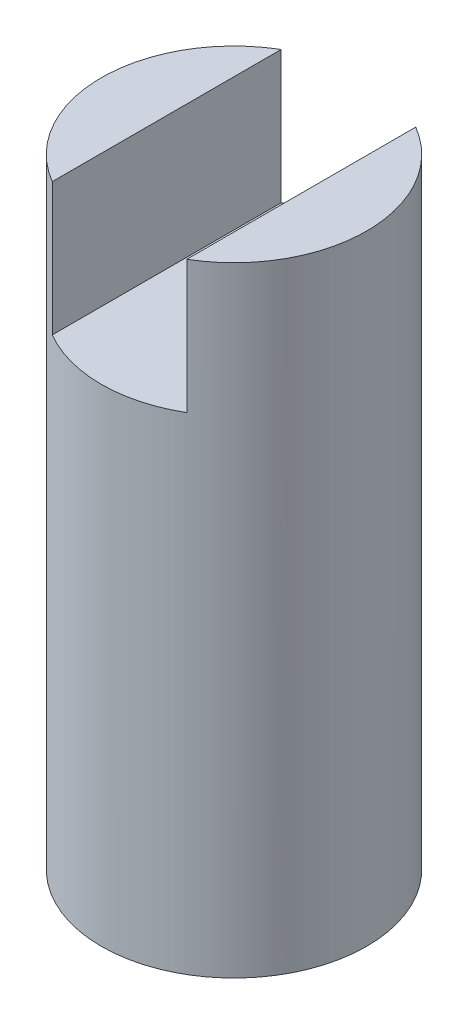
ISO-10303-21;
HEADER;
FILE_DESCRIPTION(('STEP AP214'),'2;1');
FILE_NAME('part.step','',(''),(''),'','','');
FILE_SCHEMA(('AUTOMOTIVE_DESIGN { 1 0 10303 214 1 1 1 1 }'));
ENDSEC;
DATA;
#1=APPLICATION_CONTEXT('core data for automotive mechanical design processes');
#2=APPLICATION_PROTOCOL_DEFINITION('international standard','automotive_design',2000,#1);
#3=PRODUCT_CONTEXT('',#1,'mechanical');
#4=PRODUCT('Part','Part','',(#3));
#5=PRODUCT_RELATED_PRODUCT_CATEGORY('part','',(#4));
#6=PRODUCT_DEFINITION_FORMATION('','',#4);
#7=PRODUCT_DEFINITION_CONTEXT('part definition',#1,'design');
#8=PRODUCT_DEFINITION('design','',#6,#7);
#9=PRODUCT_DEFINITION_SHAPE('','',#8);
#10=(LENGTH_UNIT() NAMED_UNIT(*) SI_UNIT(.MILLI.,.METRE.));
#11=(NAMED_UNIT(*) PLANE_ANGLE_UNIT() SI_UNIT($,.RADIAN.));
#12=(NAMED_UNIT(*) SI_UNIT($,.STERADIAN.) SOLID_ANGLE_UNIT());
#13=UNCERTAINTY_MEASURE_WITH_UNIT(LENGTH_MEASURE(1.E-05),#10,'distance_accuracy_value','');
#14=(GEOMETRIC_REPRESENTATION_CONTEXT(3) GLOBAL_UNCERTAINTY_ASSIGNED_CONTEXT((#13)) GLOBAL_UNIT_ASSIGNED_CONTEXT((#10,
#11,#12)) REPRESENTATION_CONTEXT('',''));
#15=CARTESIAN_POINT('',(0.,0.,0.));
#16=DIRECTION('',(0.,0.,1.));
#17=DIRECTION('',(1.,0.,0.));
#18=AXIS2_PLACEMENT_3D('',#15,#16,#17);
#19=CARTESIAN_POINT('',(0.,70.0000000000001,0.));
#20=DIRECTION('',(0.,1.,0.));
#21=DIRECTION('',(0.,0.,1.));
#22=AXIS2_PLACEMENT_3D('',#19,#20,#21);
#23=PLANE('',#22);
#24=CARTESIAN_POINT('',(0.,70.0000000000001,0.));
#25=DIRECTION('',(0.,1.,0.));
#26=DIRECTION('',(0.,0.,1.));
#27=AXIS2_PLACEMENT_3D('',#24,#25,#26);
#28=CIRCLE('',#27,15.);
#29=CARTESIAN_POINT('',(7.59999999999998,70.0000000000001,12.9321305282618));
#30=VERTEX_POINT('',#29);
#31=CARTESIAN_POINT('',(7.59999999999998,70.0000000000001,-12.9321305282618));
#32=VERTEX_POINT('',#31);
#33=EDGE_CURVE('E103',#30,#32,#28,.T.);
#34=ORIENTED_EDGE('',*,*,#33,.T.);
#35=DIRECTION('',(0.,0.,1.));
#36=VECTOR('',#35,1.);
#37=CARTESIAN_POINT('',(7.59999999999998,70.0000000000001,0.));
#38=LINE('',#37,#36);
#39=EDGE_CURVE('E134',#32,#30,#38,.T.);
#40=ORIENTED_EDGE('',*,*,#39,.T.);
#41=EDGE_LOOP('',(#34,#40));
#42=FACE_BOUND('',#41,.T.);
#43=ADVANCED_FACE('F42',(#42),#23,.T.);
#44=CARTESIAN_POINT('',(0.,70.0000000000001,0.));
#45=DIRECTION('',(0.,-1.,0.));
#46=DIRECTION('',(0.,0.,-1.));
#47=AXIS2_PLACEMENT_3D('',#44,#45,#46);
#48=CYLINDRICAL_SURFACE('',#47,15.);
#49=CARTESIAN_POINT('',(-7.60000000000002,70.0000000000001,-12.9321305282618));
#50=VERTEX_POINT('',#49);
#51=CARTESIAN_POINT('',(-7.60000000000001,70.0000000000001,12.9321305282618));
#52=VERTEX_POINT('',#51);
#53=EDGE_CURVE('E131',#50,#52,#28,.T.);
#54=ORIENTED_EDGE('',*,*,#53,.F.);
#55=DIRECTION('',(0.,-1.,0.));
#56=VECTOR('',#55,1.);
#57=CARTESIAN_POINT('',(-7.60000000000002,70.0000000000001,-12.9321305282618));
#58=LINE('',#57,#56);
#59=CARTESIAN_POINT('',(-7.60000000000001,54.9999999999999,-12.9321305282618));
#60=VERTEX_POINT('',#59);
#61=EDGE_CURVE('E116',#50,#60,#58,.T.);
#62=ORIENTED_EDGE('',*,*,#61,.T.);
#63=CARTESIAN_POINT('',(0.,54.9999999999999,0.));
#64=DIRECTION('',(0.,-1.,0.));
#65=DIRECTION('',(0.,0.,-1.));
#66=AXIS2_PLACEMENT_3D('',#63,#64,#65);
#67=CIRCLE('',#66,15.);
#68=CARTESIAN_POINT('',(7.60000000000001,54.9999999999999,-12.9321305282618));
#69=VERTEX_POINT('',#68);
#70=EDGE_CURVE('E11',#60,#69,#67,.T.);
#71=ORIENTED_EDGE('',*,*,#70,.T.);
#72=DIRECTION('',(0.,-1.,0.));
#73=VECTOR('',#72,1.);
#74=CARTESIAN_POINT('',(7.59999999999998,70.0000000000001,-12.9321305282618));
#75=LINE('',#74,#73);
#76=EDGE_CURVE('E96',#32,#69,#75,.T.);
#77=ORIENTED_EDGE('',*,*,#76,.F.);
#78=ORIENTED_EDGE('',*,*,#33,.F.);
#79=DIRECTION('',(0.,-1.,0.));
#80=VECTOR('',#79,1.);
#81=CARTESIAN_POINT('',(7.59999999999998,70.0000000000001,12.9321305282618));
#82=LINE('',#81,#80);
#83=CARTESIAN_POINT('',(7.59999999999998,54.9999999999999,12.9321305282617));
#84=VERTEX_POINT('',#83);
#85=EDGE_CURVE('E58',#84,#30,#82,.F.);
#86=ORIENTED_EDGE('',*,*,#85,.F.);
#87=CARTESIAN_POINT('',(-7.60000000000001,54.9999999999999,12.9321305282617));
#88=VERTEX_POINT('',#87);
#89=EDGE_CURVE('E46',#84,#88,#67,.T.);
#90=ORIENTED_EDGE('',*,*,#89,.T.);
#91=DIRECTION('',(0.,-1.,0.));
#92=VECTOR('',#91,1.);
#93=CARTESIAN_POINT('',(-7.60000000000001,70.0000000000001,12.9321305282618));
#94=LINE('',#93,#92);
#95=EDGE_CURVE('E109',#88,#52,#94,.F.);
#96=ORIENTED_EDGE('',*,*,#95,.T.);
#97=EDGE_LOOP('',(#54,#62,#71,#77,#78,#86,#90,#96));
#98=FACE_BOUND('',#97,.T.);
#99=CARTESIAN_POINT('',(0.,0.,0.));
#100=DIRECTION('',(0.,1.,0.));
#101=DIRECTION('',(0.,0.,1.));
#102=AXIS2_PLACEMENT_3D('',#99,#100,#101);
#103=CIRCLE('',#102,15.);
#104=CARTESIAN_POINT('',(0.,0.,15.));
#105=VERTEX_POINT('',#104);
#106=EDGE_CURVE('E127',#105,#105,#103,.T.);
#107=ORIENTED_EDGE('',*,*,#106,.T.);
#108=EDGE_LOOP('',(#107));
#109=FACE_BOUND('',#108,.T.);
#110=ADVANCED_FACE('F44',(#98,#109),#48,.T.);
#111=DIRECTION('',(0.,0.,1.));
#112=VECTOR('',#111,1.);
#113=CARTESIAN_POINT('',(-7.60000000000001,70.0000000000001,0.));
#114=LINE('',#113,#112);
#115=EDGE_CURVE('E93',#50,#52,#114,.T.);
#116=ORIENTED_EDGE('',*,*,#115,.F.);
#117=ORIENTED_EDGE('',*,*,#53,.T.);
#118=EDGE_LOOP('',(#116,#117));
#119=FACE_BOUND('',#118,.T.);
#120=ADVANCED_FACE('F142',(#119),#23,.T.);
#121=CARTESIAN_POINT('',(0.,0.,0.));
#122=DIRECTION('',(0.,1.,0.));
#123=DIRECTION('',(0.,0.,1.));
#124=AXIS2_PLACEMENT_3D('',#121,#122,#123);
#125=PLANE('',#124);
#126=CARTESIAN_POINT('',(0.,0.,0.));
#127=DIRECTION('',(0.,-1.,0.));
#128=DIRECTION('',(0.,0.,-1.));
#129=AXIS2_PLACEMENT_3D('',#126,#127,#128);
#130=CIRCLE('',#129,2.49999999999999);
#131=CARTESIAN_POINT('',(0.,0.,-2.49999999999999));
#132=VERTEX_POINT('',#131);
#133=EDGE_CURVE('E124',#132,#132,#130,.T.);
#134=ORIENTED_EDGE('',*,*,#133,.F.);
#135=EDGE_LOOP('',(#134));
#136=FACE_BOUND('',#135,.T.);
#137=ORIENTED_EDGE('',*,*,#106,.F.);
#138=EDGE_LOOP('',(#137));
#139=FACE_BOUND('',#138,.T.);
#140=ADVANCED_FACE('F144',(#136,#139),#125,.F.);
#141=CARTESIAN_POINT('',(0.,0.,0.));
#142=DIRECTION('',(0.,-1.,0.));
#143=DIRECTION('',(0.,0.,-1.));
#144=AXIS2_PLACEMENT_3D('',#141,#142,#143);
#145=CYLINDRICAL_SURFACE('',#144,2.49999999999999);
#146=CARTESIAN_POINT('',(0.,14.9999999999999,0.));
#147=DIRECTION('',(0.,-1.,0.));
#148=DIRECTION('',(0.,0.,-1.));
#149=AXIS2_PLACEMENT_3D('',#146,#147,#148);
#150=CIRCLE('',#149,2.49999999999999);
#151=CARTESIAN_POINT('',(0.,14.9999999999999,-2.49999999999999));
#152=VERTEX_POINT('',#151);
#153=EDGE_CURVE('E120',#152,#152,#150,.T.);
#154=ORIENTED_EDGE('',*,*,#153,.F.);
#155=EDGE_LOOP('',(#154));
#156=FACE_BOUND('',#155,.T.);
#157=ORIENTED_EDGE('',*,*,#133,.T.);
#158=EDGE_LOOP('',(#157));
#159=FACE_BOUND('',#158,.T.);
#160=ADVANCED_FACE('F149',(#156,#159),#145,.F.);
#161=CARTESIAN_POINT('',(0.,14.9999999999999,0.));
#162=DIRECTION('',(0.,-1.,0.));
#163=DIRECTION('',(0.,0.,-1.));
#164=AXIS2_PLACEMENT_3D('',#161,#162,#163);
#165=CONICAL_SURFACE('',#164,2.49999999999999,1.02974425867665);
#166=CARTESIAN_POINT('',(0.,16.502151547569,0.));
#167=VERTEX_POINT('',#166);
#168=VERTEX_LOOP('',#167);
#169=FACE_BOUND('',#168,.T.);
#170=ORIENTED_EDGE('',*,*,#153,.T.);
#171=EDGE_LOOP('',(#170));
#172=FACE_BOUND('',#171,.T.);
#173=ADVANCED_FACE('F177',(#169,#172),#165,.F.);
#174=CARTESIAN_POINT('',(-7.60000000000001,54.9999999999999,25.));
#175=DIRECTION('',(0.,-1.,0.));
#176=DIRECTION('',(0.,0.,-1.));
#177=AXIS2_PLACEMENT_3D('',#174,#175,#176);
#178=PLANE('',#177);
#179=DIRECTION('',(0.,0.,-1.));
#180=VECTOR('',#179,1.);
#181=CARTESIAN_POINT('',(7.60000000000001,54.9999999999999,25.));
#182=LINE('',#181,#180);
#183=EDGE_CURVE('E87',#84,#69,#182,.T.);
#184=ORIENTED_EDGE('',*,*,#183,.T.);
#185=ORIENTED_EDGE('',*,*,#70,.F.);
#186=DIRECTION('',(0.,0.,-1.));
#187=VECTOR('',#186,1.);
#188=CARTESIAN_POINT('',(-7.60000000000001,54.9999999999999,25.));
#189=LINE('',#188,#187);
#190=EDGE_CURVE('E89',#88,#60,#189,.T.);
#191=ORIENTED_EDGE('',*,*,#190,.F.);
#192=ORIENTED_EDGE('',*,*,#89,.F.);
#193=EDGE_LOOP('',(#184,#185,#191,#192));
#194=FACE_BOUND('',#193,.T.);
#195=ADVANCED_FACE('F86',(#194),#178,.F.);
#196=CARTESIAN_POINT('',(-7.60000000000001,85.0000000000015,25.));
#197=DIRECTION('',(-1.,0.,0.));
#198=DIRECTION('',(0.,0.,1.));
#199=AXIS2_PLACEMENT_3D('',#196,#197,#198);
#200=PLANE('',#199);
#201=ORIENTED_EDGE('',*,*,#115,.T.);
#202=ORIENTED_EDGE('',*,*,#95,.F.);
#203=ORIENTED_EDGE('',*,*,#190,.T.);
#204=ORIENTED_EDGE('',*,*,#61,.F.);
#205=EDGE_LOOP('',(#201,#202,#203,#204));
#206=FACE_BOUND('',#205,.T.);
#207=ADVANCED_FACE('F139',(#206),#200,.F.);
#208=CARTESIAN_POINT('',(7.59999999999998,85.0000000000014,25.));
#209=DIRECTION('',(-1.,0.,0.));
#210=DIRECTION('',(0.,0.,1.));
#211=AXIS2_PLACEMENT_3D('',#208,#209,#210);
#212=PLANE('',#211);
#213=ORIENTED_EDGE('',*,*,#76,.T.);
#214=ORIENTED_EDGE('',*,*,#183,.F.);
#215=ORIENTED_EDGE('',*,*,#85,.T.);
#216=ORIENTED_EDGE('',*,*,#39,.F.);
#217=EDGE_LOOP('',(#213,#214,#215,#216));
#218=FACE_BOUND('',#217,.T.);
#219=ADVANCED_FACE('F94',(#218),#212,.T.);
#220=CLOSED_SHELL('',(#43,#110,#120,#140,#160,#173,#195,#207,#219));
#221=MANIFOLD_SOLID_BREP('B2',#220);
#222=ADVANCED_BREP_SHAPE_REPRESENTATION('',(#18,#221),#14);
#223=SHAPE_DEFINITION_REPRESENTATION(#9,#222);
ENDSEC;
END-ISO-10303-21;
